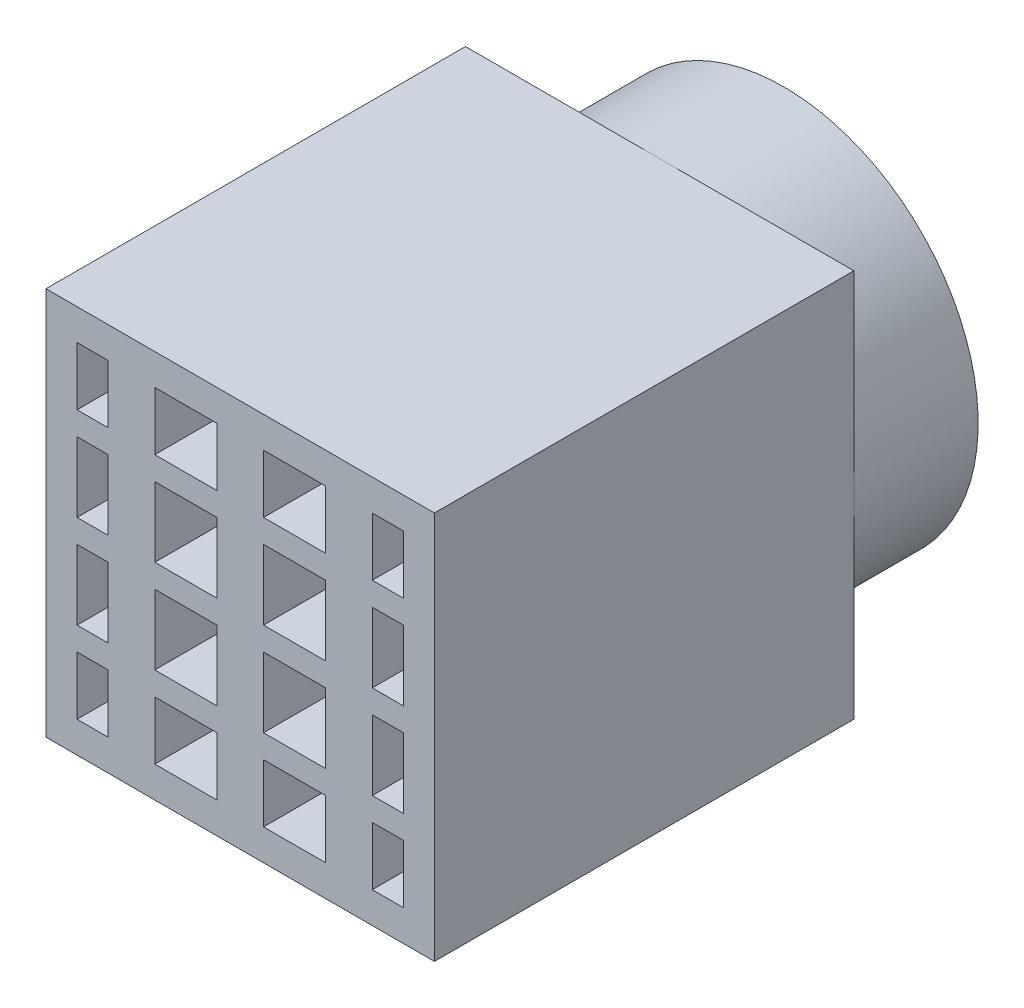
from build123d import *

# Parameters (mm, degrees)
SKETCH_8_W       = 25
SKETCH_8_H       = 25
SKETCH_8_W_2     = 4
SKETCH_8_H_2     = 21
SKETCH_8_W_3     = 2
EXTRUDE_7_DEPTH  = 25
SKETCH_9_W       = 25
SKETCH_9_H       = 25
EXTRUDE_8_DEPTH  = 2
SKETCH_14_W      = 25
SKETCH_14_H      = 1.5
EXTRUDE_11_DEPTH = 25
SKETCH_16_R      = 12.5
SKETCH_16_R_2    = 10
EXTRUDE_14_DEPTH = 6
SKETCH_17_R      = 12.5
EXTRUDE_15_DEPTH = 2


with BuildPart() as part:
    # Sketch 8 → Extrude 7 (new body)
    with BuildSketch(Plane.XY):
        Rectangle(SKETCH_8_W, SKETCH_8_H)
        with Locations((3.5, 0)):
            Rectangle(SKETCH_8_W_2, SKETCH_8_H_2, mode=Mode.SUBTRACT)
        with Locations((-3.5, 0)):
            Rectangle(SKETCH_8_W_2, SKETCH_8_H_2, mode=Mode.SUBTRACT)
        with Locations((-9.5, 0)):
            Rectangle(SKETCH_8_W_3, SKETCH_8_H_2, mode=Mode.SUBTRACT)
        with Locations((9.5, 0)):
            Rectangle(SKETCH_8_W_3, SKETCH_8_H_2, mode=Mode.SUBTRACT)
    extrude(amount=EXTRUDE_7_DEPTH)

    # Sketch 9 → Extrude 8 (add)
    with BuildSketch(Plane(origin=(0, 0, 0), x_dir=(-1, 0, 0), z_dir=(0, 0, -1))):
        Rectangle(SKETCH_9_W, SKETCH_9_H)
    extrude(amount=EXTRUDE_8_DEPTH)

    # Sketch 14 → Extrude 11 (add)
    with BuildSketch(Plane.XY.offset(25)):
        Rectangle(SKETCH_14_W, SKETCH_14_H)
        with Locations((0, 6)):
            Rectangle(SKETCH_14_W, SKETCH_14_H)
        with Locations((0, -6)):
            Rectangle(SKETCH_14_W, SKETCH_14_H)
    extrude(amount=-EXTRUDE_11_DEPTH)

    # Sketch 16 → Extrude 14 (add)
    with BuildSketch(Plane(origin=(0, 0, -2), x_dir=(-1, 0, 0), z_dir=(0, 0, -1))):
        Circle(SKETCH_16_R)
        Circle(SKETCH_16_R_2, mode=Mode.SUBTRACT)
    extrude(amount=EXTRUDE_14_DEPTH)

    # Sketch 17 → Extrude 15 (add)
    with BuildSketch(Plane(origin=(0, 0, -8), x_dir=(-1, 0, 0), z_dir=(0, 0, -1))):
        Circle(SKETCH_17_R)
    extrude(amount=EXTRUDE_15_DEPTH)


solid = part.part
